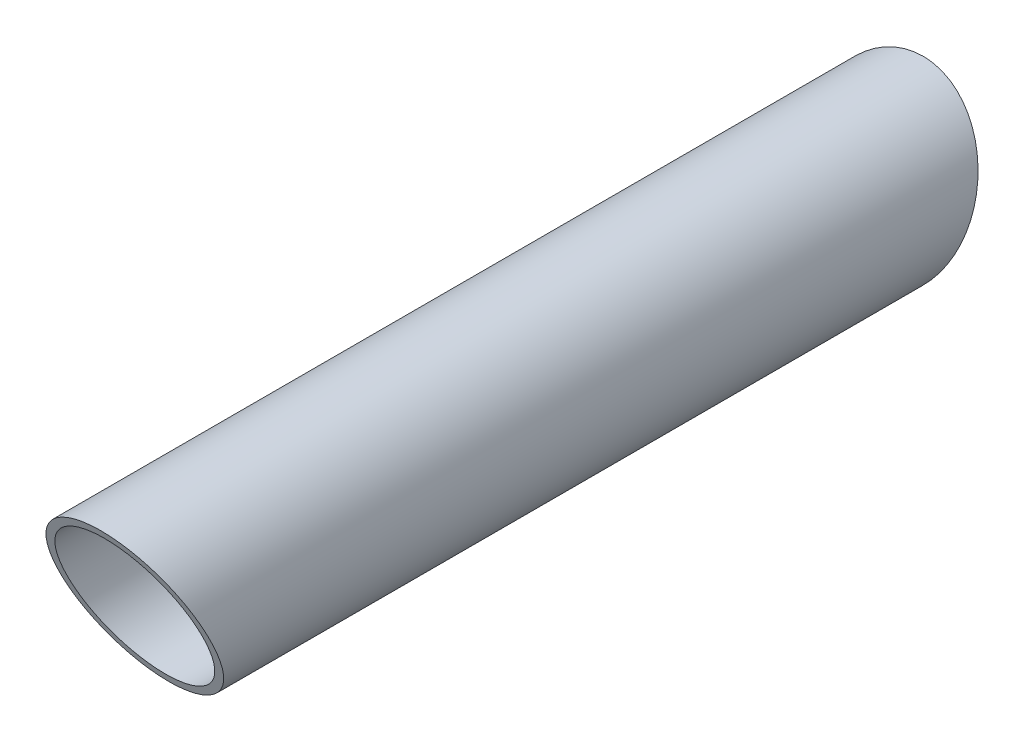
from build123d import *

# Parameters (mm, degrees)
SKIZZE1_R                       = 20
SKIZZE1_R_2                     = 18
AUFSATZ_LINEAR_AUSTRAGEN1_DEPTH = 100
SCHNITT_LINEAR_AUSTRAGEN1_DEPTH = 20


with BuildPart() as part:
    # Skizze1 → Aufsatz-Linear austragen1 (new, symmetric)
    with BuildSketch(Plane.XY):
        Circle(SKIZZE1_R)
        Circle(SKIZZE1_R_2, mode=Mode.SUBTRACT)
    extrude(amount=AUFSATZ_LINEAR_AUSTRAGEN1_DEPTH, both=True)

    # Skizze2 → Schnitt-Linear austragen1 (cut, symmetric)
    with BuildSketch(Plane(origin=(0, 0, 0), x_dir=(0, 0, -1), z_dir=(1, 0, 0))):
        Polygon((-100, 20), (-100, -20), (-83.513189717, -20), align=None)
        Polygon((83.513189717, -20), (100, 20), (100, -20), align=None)
    extrude(amount=SCHNITT_LINEAR_AUSTRAGEN1_DEPTH, both=True, mode=Mode.SUBTRACT)


solid = part.part
